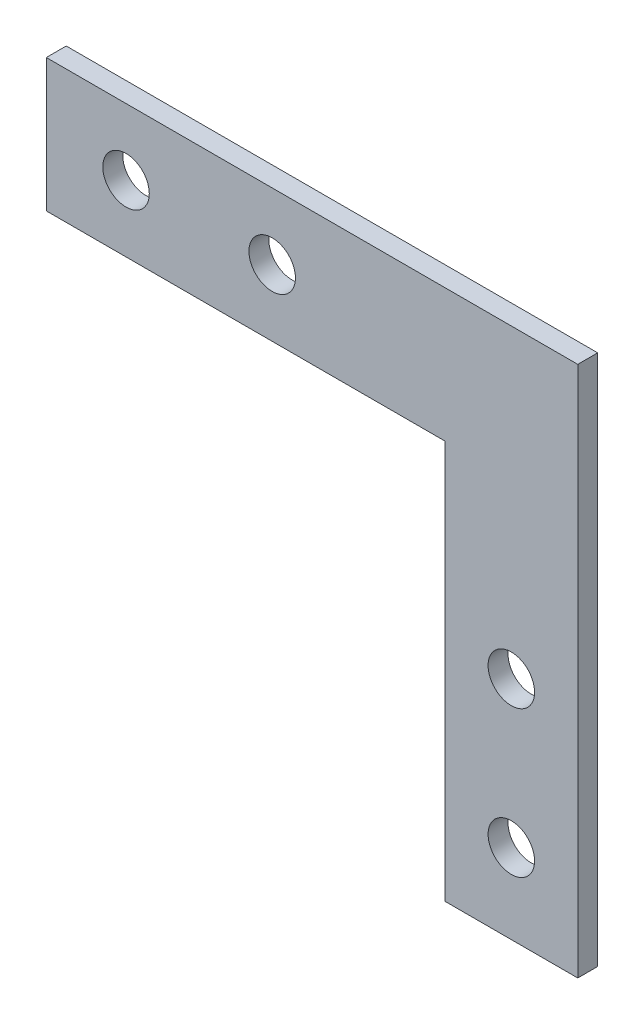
from build123d import *

# Parameters (mm, degrees)
ESQUISSE1_R      = 3.5
EXTRUSION1_DEPTH = 3


with BuildPart() as part:
    # Esquisse1 → Extrusion1 (new body)
    with BuildSketch(Plane.XY):
        Polygon((0, 0), (60, 0), (60, -60), (80, -60), (80, 0), (80, 20), (0, 20), align=None)
        with Locations((12, 10)):
            Circle(ESQUISSE1_R, mode=Mode.SUBTRACT)
        with Locations((34, 10)):
            Circle(ESQUISSE1_R, mode=Mode.SUBTRACT)
        with Locations((70, -48)):
            Circle(ESQUISSE1_R, mode=Mode.SUBTRACT)
        with Locations((70, -26)):
            Circle(ESQUISSE1_R, mode=Mode.SUBTRACT)
    extrude(amount=EXTRUSION1_DEPTH)


solid = part.part
